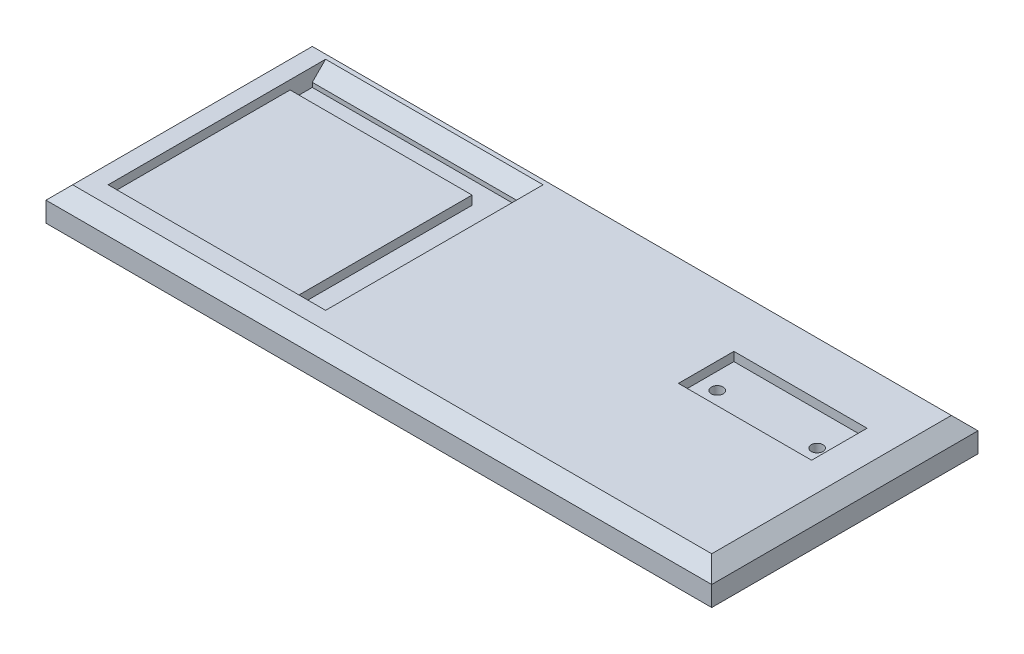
ISO-10303-21;
HEADER;
FILE_DESCRIPTION(('STEP AP214'),'2;1');
FILE_NAME('part.step','',(''),(''),'','','');
FILE_SCHEMA(('AUTOMOTIVE_DESIGN { 1 0 10303 214 1 1 1 1 }'));
ENDSEC;
DATA;
#1=APPLICATION_CONTEXT('core data for automotive mechanical design processes');
#2=APPLICATION_PROTOCOL_DEFINITION('international standard','automotive_design',2000,#1);
#3=PRODUCT_CONTEXT('',#1,'mechanical');
#4=PRODUCT('Part','Part','',(#3));
#5=PRODUCT_RELATED_PRODUCT_CATEGORY('part','',(#4));
#6=PRODUCT_DEFINITION_FORMATION('','',#4);
#7=PRODUCT_DEFINITION_CONTEXT('part definition',#1,'design');
#8=PRODUCT_DEFINITION('design','',#6,#7);
#9=PRODUCT_DEFINITION_SHAPE('','',#8);
#10=(LENGTH_UNIT() NAMED_UNIT(*) SI_UNIT(.MILLI.,.METRE.));
#11=(NAMED_UNIT(*) PLANE_ANGLE_UNIT() SI_UNIT($,.RADIAN.));
#12=(NAMED_UNIT(*) SI_UNIT($,.STERADIAN.) SOLID_ANGLE_UNIT());
#13=UNCERTAINTY_MEASURE_WITH_UNIT(LENGTH_MEASURE(1.E-05),#10,'distance_accuracy_value','');
#14=(GEOMETRIC_REPRESENTATION_CONTEXT(3) GLOBAL_UNCERTAINTY_ASSIGNED_CONTEXT((#13)) GLOBAL_UNIT_ASSIGNED_CONTEXT((#10,
#11,#12)) REPRESENTATION_CONTEXT('',''));
#15=CARTESIAN_POINT('',(0.,0.,0.));
#16=DIRECTION('',(0.,0.,1.));
#17=DIRECTION('',(1.,0.,0.));
#18=AXIS2_PLACEMENT_3D('',#15,#16,#17);
#19=CARTESIAN_POINT('',(-319.318472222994,-19.05,0.));
#20=DIRECTION('',(0.,1.,0.));
#21=DIRECTION('',(0.,0.,1.));
#22=AXIS2_PLACEMENT_3D('',#19,#20,#21);
#23=PLANE('',#22);
#24=CARTESIAN_POINT('',(155.575,-19.05,-19.05));
#25=DIRECTION('',(0.,-1.,0.));
#26=DIRECTION('',(0.,0.,-1.));
#27=AXIS2_PLACEMENT_3D('',#24,#25,#26);
#28=CIRCLE('',#27,7.14375);
#29=CARTESIAN_POINT('',(155.575,-19.05,-26.19375));
#30=VERTEX_POINT('',#29);
#31=EDGE_CURVE('E283',#30,#30,#28,.T.);
#32=ORIENTED_EDGE('',*,*,#31,.F.);
#33=EDGE_LOOP('',(#32));
#34=FACE_BOUND('',#33,.T.);
#35=DIRECTION('',(-1.,0.,0.));
#36=VECTOR('',#35,1.);
#37=CARTESIAN_POINT('',(-319.318472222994,-19.05,-76.1999999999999));
#38=LINE('',#37,#36);
#39=CARTESIAN_POINT('',(190.5,-19.05,-76.2));
#40=VERTEX_POINT('',#39);
#41=CARTESIAN_POINT('',(-190.5,-19.05,-76.2));
#42=VERTEX_POINT('',#41);
#43=EDGE_CURVE('E391',#40,#42,#38,.T.);
#44=ORIENTED_EDGE('',*,*,#43,.F.);
#45=DIRECTION('',(0.,0.,1.));
#46=VECTOR('',#45,1.);
#47=CARTESIAN_POINT('',(190.5,-19.05,0.));
#48=LINE('',#47,#46);
#49=CARTESIAN_POINT('',(190.5,-19.05,76.2));
#50=VERTEX_POINT('',#49);
#51=EDGE_CURVE('E405',#40,#50,#48,.T.);
#52=ORIENTED_EDGE('',*,*,#51,.T.);
#53=DIRECTION('',(-1.,0.,0.));
#54=VECTOR('',#53,1.);
#55=CARTESIAN_POINT('',(-319.318472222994,-19.05,76.2000000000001));
#56=LINE('',#55,#54);
#57=CARTESIAN_POINT('',(-190.5,-19.05,76.2));
#58=VERTEX_POINT('',#57);
#59=EDGE_CURVE('E403',#50,#58,#56,.T.);
#60=ORIENTED_EDGE('',*,*,#59,.T.);
#61=DIRECTION('',(0.,0.,1.));
#62=VECTOR('',#61,1.);
#63=CARTESIAN_POINT('',(-190.5,-19.05,0.));
#64=LINE('',#63,#62);
#65=EDGE_CURVE('E400',#42,#58,#64,.T.);
#66=ORIENTED_EDGE('',*,*,#65,.F.);
#67=EDGE_LOOP('',(#44,#52,#60,#66));
#68=FACE_BOUND('',#67,.T.);
#69=CARTESIAN_POINT('',(98.425,-19.05,-19.05));
#70=DIRECTION('',(0.,-1.,0.));
#71=DIRECTION('',(0.,0.,-1.));
#72=AXIS2_PLACEMENT_3D('',#69,#70,#71);
#73=CIRCLE('',#72,7.14375);
#74=CARTESIAN_POINT('',(98.425,-19.05,-26.19375));
#75=VERTEX_POINT('',#74);
#76=EDGE_CURVE('E242',#75,#75,#73,.T.);
#77=ORIENTED_EDGE('',*,*,#76,.F.);
#78=EDGE_LOOP('',(#77));
#79=FACE_BOUND('',#78,.T.);
#80=ADVANCED_FACE('F40',(#34,#68,#79),#23,.F.);
#81=CARTESIAN_POINT('',(-319.318472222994,0.,0.));
#82=DIRECTION('',(0.,1.,0.));
#83=DIRECTION('',(0.,0.,1.));
#84=AXIS2_PLACEMENT_3D('',#81,#82,#83);
#85=PLANE('',#84);
#86=DIRECTION('',(1.,0.,0.));
#87=VECTOR('',#86,1.);
#88=CARTESIAN_POINT('',(190.5,0.,68.58));
#89=LINE('',#88,#87);
#90=CARTESIAN_POINT('',(-182.88,0.,68.58));
#91=VERTEX_POINT('',#90);
#92=CARTESIAN_POINT('',(182.88,0.,68.58));
#93=VERTEX_POINT('',#92);
#94=EDGE_CURVE('E259',#91,#93,#89,.T.);
#95=ORIENTED_EDGE('',*,*,#94,.T.);
#96=DIRECTION('',(0.,0.,-1.));
#97=VECTOR('',#96,1.);
#98=CARTESIAN_POINT('',(182.88,0.,-76.2));
#99=LINE('',#98,#97);
#100=CARTESIAN_POINT('',(182.88,0.,-68.58));
#101=VERTEX_POINT('',#100);
#102=EDGE_CURVE('E261',#93,#101,#99,.T.);
#103=ORIENTED_EDGE('',*,*,#102,.T.);
#104=DIRECTION('',(-1.,0.,0.));
#105=VECTOR('',#104,1.);
#106=CARTESIAN_POINT('',(-319.318472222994,0.,-68.5799999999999));
#107=LINE('',#106,#105);
#108=CARTESIAN_POINT('',(-182.88,0.,-68.5799999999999));
#109=VERTEX_POINT('',#108);
#110=EDGE_CURVE('E255',#101,#109,#107,.T.);
#111=ORIENTED_EDGE('',*,*,#110,.T.);
#112=DIRECTION('',(0.,0.,1.));
#113=VECTOR('',#112,1.);
#114=CARTESIAN_POINT('',(-182.88,0.,0.));
#115=LINE('',#114,#113);
#116=EDGE_CURVE('E257',#109,#91,#115,.T.);
#117=ORIENTED_EDGE('',*,*,#116,.T.);
#118=EDGE_LOOP('',(#95,#103,#111,#117));
#119=FACE_BOUND('',#118,.T.);
#120=DIRECTION('',(0.,0.,1.));
#121=VECTOR('',#120,1.);
#122=CARTESIAN_POINT('',(-48.2600000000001,0.,0.));
#123=LINE('',#122,#121);
#124=CARTESIAN_POINT('',(-48.2600000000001,0.,-66.0399999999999));
#125=VERTEX_POINT('',#124);
#126=CARTESIAN_POINT('',(-48.2600000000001,0.,58.42));
#127=VERTEX_POINT('',#126);
#128=EDGE_CURVE('E251',#125,#127,#123,.T.);
#129=ORIENTED_EDGE('',*,*,#128,.T.);
#130=DIRECTION('',(-1.,0.,0.));
#131=VECTOR('',#130,1.);
#132=CARTESIAN_POINT('',(-319.318472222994,0.,58.4199999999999));
#133=LINE('',#132,#131);
#134=CARTESIAN_POINT('',(-172.72,0.,58.42));
#135=VERTEX_POINT('',#134);
#136=EDGE_CURVE('E425',#127,#135,#133,.T.);
#137=ORIENTED_EDGE('',*,*,#136,.T.);
#138=DIRECTION('',(0.,0.,1.));
#139=VECTOR('',#138,1.);
#140=CARTESIAN_POINT('',(-172.72,0.,0.));
#141=LINE('',#140,#139);
#142=CARTESIAN_POINT('',(-172.72,0.,-66.04));
#143=VERTEX_POINT('',#142);
#144=EDGE_CURVE('E383',#143,#135,#141,.T.);
#145=ORIENTED_EDGE('',*,*,#144,.F.);
#146=DIRECTION('',(1.,0.,0.));
#147=VECTOR('',#146,1.);
#148=CARTESIAN_POINT('',(-55.88,0.,-66.0399999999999));
#149=LINE('',#148,#147);
#150=EDGE_CURVE('E247',#143,#125,#149,.T.);
#151=ORIENTED_EDGE('',*,*,#150,.T.);
#152=EDGE_LOOP('',(#129,#137,#145,#151));
#153=FACE_BOUND('',#152,.T.);
#154=DIRECTION('',(1.,0.,0.));
#155=VECTOR('',#154,1.);
#156=CARTESIAN_POINT('',(-319.318472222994,0.,-38.1));
#157=LINE('',#156,#155);
#158=CARTESIAN_POINT('',(88.9,0.,-38.1));
#159=VERTEX_POINT('',#158);
#160=CARTESIAN_POINT('',(165.1,0.,-38.1));
#161=VERTEX_POINT('',#160);
#162=EDGE_CURVE('E461',#159,#161,#157,.T.);
#163=ORIENTED_EDGE('',*,*,#162,.T.);
#164=DIRECTION('',(0.,0.,1.));
#165=VECTOR('',#164,1.);
#166=CARTESIAN_POINT('',(165.1,0.,-3.48490408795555E-13));
#167=LINE('',#166,#165);
#168=CARTESIAN_POINT('',(165.1,0.,-6.34999999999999));
#169=VERTEX_POINT('',#168);
#170=EDGE_CURVE('E458',#161,#169,#167,.T.);
#171=ORIENTED_EDGE('',*,*,#170,.T.);
#172=DIRECTION('',(1.,0.,0.));
#173=VECTOR('',#172,1.);
#174=CARTESIAN_POINT('',(-319.318472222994,0.,-6.34999999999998));
#175=LINE('',#174,#173);
#176=CARTESIAN_POINT('',(88.9,0.,-6.34999999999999));
#177=VERTEX_POINT('',#176);
#178=EDGE_CURVE('E436',#177,#169,#175,.T.);
#179=ORIENTED_EDGE('',*,*,#178,.F.);
#180=DIRECTION('',(0.,0.,1.));
#181=VECTOR('',#180,1.);
#182=CARTESIAN_POINT('',(88.9,0.,0.));
#183=LINE('',#182,#181);
#184=EDGE_CURVE('E462',#159,#177,#183,.T.);
#185=ORIENTED_EDGE('',*,*,#184,.F.);
#186=EDGE_LOOP('',(#163,#171,#179,#185));
#187=FACE_BOUND('',#186,.T.);
#188=ADVANCED_FACE('F322',(#119,#153,#187),#85,.T.);
#189=CARTESIAN_POINT('',(-319.318472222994,-19.05,-76.1999999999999));
#190=DIRECTION('',(0.,0.,-1.));
#191=DIRECTION('',(-1.,0.,0.));
#192=AXIS2_PLACEMENT_3D('',#189,#190,#191);
#193=PLANE('',#192);
#194=DIRECTION('',(0.,1.,0.));
#195=VECTOR('',#194,1.);
#196=CARTESIAN_POINT('',(-190.5,-19.05,-76.2));
#197=LINE('',#196,#195);
#198=CARTESIAN_POINT('',(-190.5,-7.62000000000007,-76.2));
#199=VERTEX_POINT('',#198);
#200=EDGE_CURVE('E407',#42,#199,#197,.T.);
#201=ORIENTED_EDGE('',*,*,#200,.T.);
#202=DIRECTION('',(1.,0.,0.));
#203=VECTOR('',#202,1.);
#204=CARTESIAN_POINT('',(-319.318472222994,-7.62000000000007,-76.1999999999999));
#205=LINE('',#204,#203);
#206=CARTESIAN_POINT('',(190.5,-7.62000000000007,-76.2));
#207=VERTEX_POINT('',#206);
#208=EDGE_CURVE('E268',#199,#207,#205,.T.);
#209=ORIENTED_EDGE('',*,*,#208,.T.);
#210=DIRECTION('',(0.,1.,0.));
#211=VECTOR('',#210,1.);
#212=CARTESIAN_POINT('',(190.5,-19.05,-76.2));
#213=LINE('',#212,#211);
#214=EDGE_CURVE('E248',#40,#207,#213,.T.);
#215=ORIENTED_EDGE('',*,*,#214,.F.);
#216=ORIENTED_EDGE('',*,*,#43,.T.);
#217=EDGE_LOOP('',(#201,#209,#215,#216));
#218=FACE_BOUND('',#217,.T.);
#219=ADVANCED_FACE('F328',(#218),#193,.T.);
#220=CARTESIAN_POINT('',(190.5,-19.05,0.));
#221=DIRECTION('',(-1.,0.,0.));
#222=DIRECTION('',(0.,0.,1.));
#223=AXIS2_PLACEMENT_3D('',#220,#221,#222);
#224=PLANE('',#223);
#225=ORIENTED_EDGE('',*,*,#214,.T.);
#226=DIRECTION('',(0.,0.,1.));
#227=VECTOR('',#226,1.);
#228=CARTESIAN_POINT('',(190.5,-7.62000000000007,76.2));
#229=LINE('',#228,#227);
#230=CARTESIAN_POINT('',(190.5,-7.62000000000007,76.2));
#231=VERTEX_POINT('',#230);
#232=EDGE_CURVE('E244',#207,#231,#229,.T.);
#233=ORIENTED_EDGE('',*,*,#232,.T.);
#234=DIRECTION('',(0.,1.,0.));
#235=VECTOR('',#234,1.);
#236=CARTESIAN_POINT('',(190.5,-19.05,76.2));
#237=LINE('',#236,#235);
#238=EDGE_CURVE('E410',#50,#231,#237,.T.);
#239=ORIENTED_EDGE('',*,*,#238,.F.);
#240=ORIENTED_EDGE('',*,*,#51,.F.);
#241=EDGE_LOOP('',(#225,#233,#239,#240));
#242=FACE_BOUND('',#241,.T.);
#243=ADVANCED_FACE('F335',(#242),#224,.F.);
#244=CARTESIAN_POINT('',(-319.318472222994,-19.05,76.2000000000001));
#245=DIRECTION('',(0.,0.,-1.));
#246=DIRECTION('',(-1.,0.,0.));
#247=AXIS2_PLACEMENT_3D('',#244,#245,#246);
#248=PLANE('',#247);
#249=ORIENTED_EDGE('',*,*,#238,.T.);
#250=DIRECTION('',(-1.,0.,0.));
#251=VECTOR('',#250,1.);
#252=CARTESIAN_POINT('',(-190.5,-7.62000000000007,76.2));
#253=LINE('',#252,#251);
#254=CARTESIAN_POINT('',(-190.5,-7.62000000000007,76.2));
#255=VERTEX_POINT('',#254);
#256=EDGE_CURVE('E264',#231,#255,#253,.T.);
#257=ORIENTED_EDGE('',*,*,#256,.T.);
#258=DIRECTION('',(0.,1.,0.));
#259=VECTOR('',#258,1.);
#260=CARTESIAN_POINT('',(-190.5,-19.05,76.2));
#261=LINE('',#260,#259);
#262=EDGE_CURVE('E413',#58,#255,#261,.T.);
#263=ORIENTED_EDGE('',*,*,#262,.F.);
#264=ORIENTED_EDGE('',*,*,#59,.F.);
#265=EDGE_LOOP('',(#249,#257,#263,#264));
#266=FACE_BOUND('',#265,.T.);
#267=ADVANCED_FACE('F338',(#266),#248,.F.);
#268=CARTESIAN_POINT('',(-190.5,-19.05,0.));
#269=DIRECTION('',(-1.,0.,0.));
#270=DIRECTION('',(0.,0.,1.));
#271=AXIS2_PLACEMENT_3D('',#268,#269,#270);
#272=PLANE('',#271);
#273=ORIENTED_EDGE('',*,*,#262,.T.);
#274=DIRECTION('',(0.,0.,-1.));
#275=VECTOR('',#274,1.);
#276=CARTESIAN_POINT('',(-190.5,-7.62000000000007,0.));
#277=LINE('',#276,#275);
#278=EDGE_CURVE('E266',#255,#199,#277,.T.);
#279=ORIENTED_EDGE('',*,*,#278,.T.);
#280=ORIENTED_EDGE('',*,*,#200,.F.);
#281=ORIENTED_EDGE('',*,*,#65,.T.);
#282=EDGE_LOOP('',(#273,#279,#280,#281));
#283=FACE_BOUND('',#282,.T.);
#284=ADVANCED_FACE('F342',(#283),#272,.T.);
#285=CARTESIAN_POINT('',(-319.318472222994,-5.08,58.4199999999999));
#286=DIRECTION('',(0.,0.,-1.));
#287=DIRECTION('',(-1.,0.,0.));
#288=AXIS2_PLACEMENT_3D('',#285,#286,#287);
#289=PLANE('',#288);
#290=ORIENTED_EDGE('',*,*,#136,.F.);
#291=DIRECTION('',(0.707106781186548,0.707106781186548,0.));
#292=VECTOR('',#291,1.);
#293=CARTESIAN_POINT('',(-48.2600000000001,0.,58.42));
#294=LINE('',#293,#292);
#295=CARTESIAN_POINT('',(-55.88,-7.61999999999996,58.42));
#296=VERTEX_POINT('',#295);
#297=EDGE_CURVE('E49',#127,#296,#294,.F.);
#298=ORIENTED_EDGE('',*,*,#297,.T.);
#299=DIRECTION('',(0.,1.,0.));
#300=VECTOR('',#299,1.);
#301=CARTESIAN_POINT('',(-55.88,-5.08,58.42));
#302=LINE('',#301,#300);
#303=CARTESIAN_POINT('',(-55.88,-10.16,58.42));
#304=VERTEX_POINT('',#303);
#305=EDGE_CURVE('E188',#304,#296,#302,.T.);
#306=ORIENTED_EDGE('',*,*,#305,.F.);
#307=DIRECTION('',(1.,0.,0.));
#308=VECTOR('',#307,1.);
#309=CARTESIAN_POINT('',(-55.88,-10.16,58.42));
#310=LINE('',#309,#308);
#311=CARTESIAN_POINT('',(-68.5800000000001,-10.16,58.42));
#312=VERTEX_POINT('',#311);
#313=EDGE_CURVE('E186',#312,#304,#310,.T.);
#314=ORIENTED_EDGE('',*,*,#313,.F.);
#315=DIRECTION('',(0.,1.,0.));
#316=VECTOR('',#315,1.);
#317=CARTESIAN_POINT('',(-68.5800000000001,-10.16,58.42));
#318=LINE('',#317,#316);
#319=CARTESIAN_POINT('',(-68.5800000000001,-5.08,58.42));
#320=VERTEX_POINT('',#319);
#321=EDGE_CURVE('E172',#312,#320,#318,.T.);
#322=ORIENTED_EDGE('',*,*,#321,.T.);
#323=DIRECTION('',(-1.,0.,0.));
#324=VECTOR('',#323,1.);
#325=CARTESIAN_POINT('',(-319.318472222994,-5.08,58.4199999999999));
#326=LINE('',#325,#324);
#327=CARTESIAN_POINT('',(-172.72,-5.08,58.42));
#328=VERTEX_POINT('',#327);
#329=EDGE_CURVE('E417',#320,#328,#326,.T.);
#330=ORIENTED_EDGE('',*,*,#329,.T.);
#331=DIRECTION('',(0.,1.,0.));
#332=VECTOR('',#331,1.);
#333=CARTESIAN_POINT('',(-172.72,-5.08,58.42));
#334=LINE('',#333,#332);
#335=EDGE_CURVE('E388',#328,#135,#334,.T.);
#336=ORIENTED_EDGE('',*,*,#335,.T.);
#337=EDGE_LOOP('',(#290,#298,#306,#314,#322,#330,#336));
#338=FACE_BOUND('',#337,.T.);
#339=ADVANCED_FACE('F187',(#338),#289,.T.);
#340=CARTESIAN_POINT('',(-172.72,-5.08,0.));
#341=DIRECTION('',(-1.,0.,0.));
#342=DIRECTION('',(0.,0.,1.));
#343=AXIS2_PLACEMENT_3D('',#340,#341,#342);
#344=PLANE('',#343);
#345=ORIENTED_EDGE('',*,*,#144,.T.);
#346=ORIENTED_EDGE('',*,*,#335,.F.);
#347=DIRECTION('',(0.,0.,1.));
#348=VECTOR('',#347,1.);
#349=CARTESIAN_POINT('',(-172.72,-5.08,0.));
#350=LINE('',#349,#348);
#351=CARTESIAN_POINT('',(-172.72,-5.08,-45.72));
#352=VERTEX_POINT('',#351);
#353=EDGE_CURVE('E224',#352,#328,#350,.T.);
#354=ORIENTED_EDGE('',*,*,#353,.F.);
#355=DIRECTION('',(0.,1.,0.));
#356=VECTOR('',#355,1.);
#357=CARTESIAN_POINT('',(-172.72,-10.16,-45.72));
#358=LINE('',#357,#356);
#359=CARTESIAN_POINT('',(-172.72,-10.16,-45.72));
#360=VERTEX_POINT('',#359);
#361=EDGE_CURVE('E182',#360,#352,#358,.T.);
#362=ORIENTED_EDGE('',*,*,#361,.F.);
#363=DIRECTION('',(0.,0.,1.));
#364=VECTOR('',#363,1.);
#365=CARTESIAN_POINT('',(-172.72,-10.16,-58.42));
#366=LINE('',#365,#364);
#367=CARTESIAN_POINT('',(-172.72,-10.16,-58.42));
#368=VERTEX_POINT('',#367);
#369=EDGE_CURVE('E215',#368,#360,#366,.T.);
#370=ORIENTED_EDGE('',*,*,#369,.F.);
#371=DIRECTION('',(0.,1.,0.));
#372=VECTOR('',#371,1.);
#373=CARTESIAN_POINT('',(-172.72,-5.08,-58.42));
#374=LINE('',#373,#372);
#375=CARTESIAN_POINT('',(-172.72,-7.61999999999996,-58.42));
#376=VERTEX_POINT('',#375);
#377=EDGE_CURVE('E386',#368,#376,#374,.T.);
#378=ORIENTED_EDGE('',*,*,#377,.T.);
#379=DIRECTION('',(0.,0.707106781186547,-0.707106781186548));
#380=VECTOR('',#379,1.);
#381=CARTESIAN_POINT('',(-172.72,-35.56,-30.4799999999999));
#382=LINE('',#381,#380);
#383=EDGE_CURVE('E11',#376,#143,#382,.T.);
#384=ORIENTED_EDGE('',*,*,#383,.T.);
#385=EDGE_LOOP('',(#345,#346,#354,#362,#370,#378,#384));
#386=FACE_BOUND('',#385,.T.);
#387=ADVANCED_FACE('F381',(#386),#344,.F.);
#388=CARTESIAN_POINT('',(-319.318472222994,-5.08,-58.4200000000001));
#389=DIRECTION('',(0.,0.,-1.));
#390=DIRECTION('',(-1.,0.,0.));
#391=AXIS2_PLACEMENT_3D('',#388,#389,#390);
#392=PLANE('',#391);
#393=DIRECTION('',(0.,1.,0.));
#394=VECTOR('',#393,1.);
#395=CARTESIAN_POINT('',(-55.88,-5.08,-58.42));
#396=LINE('',#395,#394);
#397=CARTESIAN_POINT('',(-55.8800000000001,-10.16,-58.42));
#398=VERTEX_POINT('',#397);
#399=CARTESIAN_POINT('',(-55.88,-7.61999999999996,-58.42));
#400=VERTEX_POINT('',#399);
#401=EDGE_CURVE('E389',#398,#400,#396,.T.);
#402=ORIENTED_EDGE('',*,*,#401,.T.);
#403=DIRECTION('',(-1.,0.,0.));
#404=VECTOR('',#403,1.);
#405=CARTESIAN_POINT('',(-172.72,-7.61999999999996,-58.42));
#406=LINE('',#405,#404);
#407=EDGE_CURVE('E57',#400,#376,#406,.T.);
#408=ORIENTED_EDGE('',*,*,#407,.T.);
#409=ORIENTED_EDGE('',*,*,#377,.F.);
#410=DIRECTION('',(-1.,0.,0.));
#411=VECTOR('',#410,1.);
#412=CARTESIAN_POINT('',(-55.8800000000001,-10.16,-58.42));
#413=LINE('',#412,#411);
#414=EDGE_CURVE('E211',#398,#368,#413,.T.);
#415=ORIENTED_EDGE('',*,*,#414,.F.);
#416=EDGE_LOOP('',(#402,#408,#409,#415));
#417=FACE_BOUND('',#416,.T.);
#418=ADVANCED_FACE('F500',(#417),#392,.F.);
#419=CARTESIAN_POINT('',(-55.88,-5.08,0.));
#420=DIRECTION('',(-1.,0.,0.));
#421=DIRECTION('',(0.,0.,1.));
#422=AXIS2_PLACEMENT_3D('',#419,#420,#421);
#423=PLANE('',#422);
#424=ORIENTED_EDGE('',*,*,#305,.T.);
#425=DIRECTION('',(0.,0.,-1.));
#426=VECTOR('',#425,1.);
#427=CARTESIAN_POINT('',(-55.88,-7.61999999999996,0.));
#428=LINE('',#427,#426);
#429=EDGE_CURVE('E270',#296,#400,#428,.T.);
#430=ORIENTED_EDGE('',*,*,#429,.T.);
#431=ORIENTED_EDGE('',*,*,#401,.F.);
#432=DIRECTION('',(0.,0.,-1.));
#433=VECTOR('',#432,1.);
#434=CARTESIAN_POINT('',(-55.8800000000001,-10.16,-58.42));
#435=LINE('',#434,#433);
#436=EDGE_CURVE('E192',#304,#398,#435,.T.);
#437=ORIENTED_EDGE('',*,*,#436,.F.);
#438=EDGE_LOOP('',(#424,#430,#431,#437));
#439=FACE_BOUND('',#438,.T.);
#440=ADVANCED_FACE('F496',(#439),#423,.T.);
#441=CARTESIAN_POINT('',(-319.318472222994,-5.08,0.));
#442=DIRECTION('',(0.,1.,0.));
#443=DIRECTION('',(0.,0.,1.));
#444=AXIS2_PLACEMENT_3D('',#441,#442,#443);
#445=PLANE('',#444);
#446=DIRECTION('',(0.,0.,1.));
#447=VECTOR('',#446,1.);
#448=CARTESIAN_POINT('',(-68.5800000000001,-5.08,-45.72));
#449=LINE('',#448,#447);
#450=CARTESIAN_POINT('',(-68.5800000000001,-5.08,-45.72));
#451=VERTEX_POINT('',#450);
#452=EDGE_CURVE('E179',#451,#320,#449,.T.);
#453=ORIENTED_EDGE('',*,*,#452,.F.);
#454=DIRECTION('',(1.,0.,0.));
#455=VECTOR('',#454,1.);
#456=CARTESIAN_POINT('',(-68.5800000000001,-5.08,-45.72));
#457=LINE('',#456,#455);
#458=EDGE_CURVE('E198',#352,#451,#457,.T.);
#459=ORIENTED_EDGE('',*,*,#458,.F.);
#460=ORIENTED_EDGE('',*,*,#353,.T.);
#461=ORIENTED_EDGE('',*,*,#329,.F.);
#462=EDGE_LOOP('',(#453,#459,#460,#461));
#463=FACE_BOUND('',#462,.T.);
#464=ADVANCED_FACE('F493',(#463),#445,.T.);
#465=CARTESIAN_POINT('',(165.1,-5.08,-3.48490408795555E-13));
#466=DIRECTION('',(-1.,0.,0.));
#467=DIRECTION('',(0.,0.,1.));
#468=AXIS2_PLACEMENT_3D('',#465,#466,#467);
#469=PLANE('',#468);
#470=ORIENTED_EDGE('',*,*,#170,.F.);
#471=DIRECTION('',(0.,1.,0.));
#472=VECTOR('',#471,1.);
#473=CARTESIAN_POINT('',(165.1,-5.08,-38.1));
#474=LINE('',#473,#472);
#475=CARTESIAN_POINT('',(165.1,-5.08,-38.1));
#476=VERTEX_POINT('',#475);
#477=EDGE_CURVE('E421',#476,#161,#474,.T.);
#478=ORIENTED_EDGE('',*,*,#477,.F.);
#479=DIRECTION('',(0.,0.,1.));
#480=VECTOR('',#479,1.);
#481=CARTESIAN_POINT('',(165.1,-5.08,-3.48490408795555E-13));
#482=LINE('',#481,#480);
#483=CARTESIAN_POINT('',(165.1,-5.08,-6.34999999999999));
#484=VERTEX_POINT('',#483);
#485=EDGE_CURVE('E465',#476,#484,#482,.T.);
#486=ORIENTED_EDGE('',*,*,#485,.T.);
#487=DIRECTION('',(0.,1.,0.));
#488=VECTOR('',#487,1.);
#489=CARTESIAN_POINT('',(165.1,-5.08,-6.34999999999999));
#490=LINE('',#489,#488);
#491=EDGE_CURVE('E426',#484,#169,#490,.T.);
#492=ORIENTED_EDGE('',*,*,#491,.T.);
#493=EDGE_LOOP('',(#470,#478,#486,#492));
#494=FACE_BOUND('',#493,.T.);
#495=ADVANCED_FACE('F469',(#494),#469,.T.);
#496=CARTESIAN_POINT('',(-319.318472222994,-5.08,-6.34999999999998));
#497=DIRECTION('',(0.,0.,1.));
#498=DIRECTION('',(1.,0.,0.));
#499=AXIS2_PLACEMENT_3D('',#496,#497,#498);
#500=PLANE('',#499);
#501=ORIENTED_EDGE('',*,*,#178,.T.);
#502=ORIENTED_EDGE('',*,*,#491,.F.);
#503=DIRECTION('',(1.,0.,0.));
#504=VECTOR('',#503,1.);
#505=CARTESIAN_POINT('',(-319.318472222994,-5.08,-6.34999999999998));
#506=LINE('',#505,#504);
#507=CARTESIAN_POINT('',(88.9,-5.08,-6.34999999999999));
#508=VERTEX_POINT('',#507);
#509=EDGE_CURVE('E443',#508,#484,#506,.T.);
#510=ORIENTED_EDGE('',*,*,#509,.F.);
#511=DIRECTION('',(0.,1.,0.));
#512=VECTOR('',#511,1.);
#513=CARTESIAN_POINT('',(88.9,-5.08,-6.34999999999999));
#514=LINE('',#513,#512);
#515=EDGE_CURVE('E428',#508,#177,#514,.T.);
#516=ORIENTED_EDGE('',*,*,#515,.T.);
#517=EDGE_LOOP('',(#501,#502,#510,#516));
#518=FACE_BOUND('',#517,.T.);
#519=ADVANCED_FACE('F486',(#518),#500,.F.);
#520=CARTESIAN_POINT('',(88.9,-5.08,0.));
#521=DIRECTION('',(-1.,0.,0.));
#522=DIRECTION('',(0.,0.,1.));
#523=AXIS2_PLACEMENT_3D('',#520,#521,#522);
#524=PLANE('',#523);
#525=ORIENTED_EDGE('',*,*,#184,.T.);
#526=ORIENTED_EDGE('',*,*,#515,.F.);
#527=DIRECTION('',(0.,0.,1.));
#528=VECTOR('',#527,1.);
#529=CARTESIAN_POINT('',(88.9,-5.08,0.));
#530=LINE('',#529,#528);
#531=CARTESIAN_POINT('',(88.9,-5.08,-38.1));
#532=VERTEX_POINT('',#531);
#533=EDGE_CURVE('E448',#532,#508,#530,.T.);
#534=ORIENTED_EDGE('',*,*,#533,.F.);
#535=DIRECTION('',(0.,1.,0.));
#536=VECTOR('',#535,1.);
#537=CARTESIAN_POINT('',(88.9,-5.08,-38.1));
#538=LINE('',#537,#536);
#539=EDGE_CURVE('E433',#532,#159,#538,.T.);
#540=ORIENTED_EDGE('',*,*,#539,.T.);
#541=EDGE_LOOP('',(#525,#526,#534,#540));
#542=FACE_BOUND('',#541,.T.);
#543=ADVANCED_FACE('F480',(#542),#524,.F.);
#544=CARTESIAN_POINT('',(-319.318472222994,-5.08,-38.1));
#545=DIRECTION('',(0.,0.,1.));
#546=DIRECTION('',(1.,0.,0.));
#547=AXIS2_PLACEMENT_3D('',#544,#545,#546);
#548=PLANE('',#547);
#549=ORIENTED_EDGE('',*,*,#162,.F.);
#550=ORIENTED_EDGE('',*,*,#539,.F.);
#551=DIRECTION('',(1.,0.,0.));
#552=VECTOR('',#551,1.);
#553=CARTESIAN_POINT('',(-319.318472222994,-5.08,-38.1));
#554=LINE('',#553,#552);
#555=EDGE_CURVE('E454',#532,#476,#554,.T.);
#556=ORIENTED_EDGE('',*,*,#555,.T.);
#557=ORIENTED_EDGE('',*,*,#477,.T.);
#558=EDGE_LOOP('',(#549,#550,#556,#557));
#559=FACE_BOUND('',#558,.T.);
#560=ADVANCED_FACE('F468',(#559),#548,.T.);
#561=CARTESIAN_POINT('',(-319.318472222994,-5.08,0.));
#562=DIRECTION('',(0.,1.,0.));
#563=DIRECTION('',(0.,0.,1.));
#564=AXIS2_PLACEMENT_3D('',#561,#562,#563);
#565=PLANE('',#564);
#566=CARTESIAN_POINT('',(155.575,-5.08,-19.05));
#567=DIRECTION('',(0.,1.,0.));
#568=DIRECTION('',(0.,0.,1.));
#569=AXIS2_PLACEMENT_3D('',#566,#567,#568);
#570=CIRCLE('',#569,3.3782);
#571=CARTESIAN_POINT('',(155.575,-5.08,-15.6718));
#572=VERTEX_POINT('',#571);
#573=EDGE_CURVE('E239',#572,#572,#570,.T.);
#574=ORIENTED_EDGE('',*,*,#573,.F.);
#575=EDGE_LOOP('',(#574));
#576=FACE_BOUND('',#575,.T.);
#577=CARTESIAN_POINT('',(98.425,-5.08,-19.05));
#578=DIRECTION('',(0.,1.,0.));
#579=DIRECTION('',(0.,0.,1.));
#580=AXIS2_PLACEMENT_3D('',#577,#578,#579);
#581=CIRCLE('',#580,3.3782);
#582=CARTESIAN_POINT('',(98.425,-5.08,-15.6718));
#583=VERTEX_POINT('',#582);
#584=EDGE_CURVE('E234',#583,#583,#581,.T.);
#585=ORIENTED_EDGE('',*,*,#584,.F.);
#586=EDGE_LOOP('',(#585));
#587=FACE_BOUND('',#586,.T.);
#588=ORIENTED_EDGE('',*,*,#485,.F.);
#589=ORIENTED_EDGE('',*,*,#555,.F.);
#590=ORIENTED_EDGE('',*,*,#533,.T.);
#591=ORIENTED_EDGE('',*,*,#509,.T.);
#592=EDGE_LOOP('',(#588,#589,#590,#591));
#593=FACE_BOUND('',#592,.T.);
#594=ADVANCED_FACE('F470',(#576,#587,#593),#565,.T.);
#595=CARTESIAN_POINT('',(-68.5800000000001,-10.16,-45.72));
#596=DIRECTION('',(-1.,0.,0.));
#597=DIRECTION('',(0.,0.,1.));
#598=AXIS2_PLACEMENT_3D('',#595,#596,#597);
#599=PLANE('',#598);
#600=ORIENTED_EDGE('',*,*,#452,.T.);
#601=ORIENTED_EDGE('',*,*,#321,.F.);
#602=DIRECTION('',(0.,0.,1.));
#603=VECTOR('',#602,1.);
#604=CARTESIAN_POINT('',(-68.5800000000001,-10.16,-45.72));
#605=LINE('',#604,#603);
#606=CARTESIAN_POINT('',(-68.5800000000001,-10.16,-45.72));
#607=VERTEX_POINT('',#606);
#608=EDGE_CURVE('E176',#607,#312,#605,.T.);
#609=ORIENTED_EDGE('',*,*,#608,.F.);
#610=DIRECTION('',(0.,1.,0.));
#611=VECTOR('',#610,1.);
#612=CARTESIAN_POINT('',(-68.5800000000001,-10.16,-45.72));
#613=LINE('',#612,#611);
#614=EDGE_CURVE('E220',#607,#451,#613,.T.);
#615=ORIENTED_EDGE('',*,*,#614,.T.);
#616=EDGE_LOOP('',(#600,#601,#609,#615));
#617=FACE_BOUND('',#616,.T.);
#618=ADVANCED_FACE('F174',(#617),#599,.F.);
#619=CARTESIAN_POINT('',(-68.5800000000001,-10.16,-45.72));
#620=DIRECTION('',(0.,0.,1.));
#621=DIRECTION('',(1.,0.,0.));
#622=AXIS2_PLACEMENT_3D('',#619,#620,#621);
#623=PLANE('',#622);
#624=ORIENTED_EDGE('',*,*,#458,.T.);
#625=ORIENTED_EDGE('',*,*,#614,.F.);
#626=DIRECTION('',(1.,0.,0.));
#627=VECTOR('',#626,1.);
#628=CARTESIAN_POINT('',(-68.5800000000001,-10.16,-45.72));
#629=LINE('',#628,#627);
#630=EDGE_CURVE('E183',#360,#607,#629,.T.);
#631=ORIENTED_EDGE('',*,*,#630,.F.);
#632=ORIENTED_EDGE('',*,*,#361,.T.);
#633=EDGE_LOOP('',(#624,#625,#631,#632));
#634=FACE_BOUND('',#633,.T.);
#635=ADVANCED_FACE('F478',(#634),#623,.F.);
#636=CARTESIAN_POINT('',(-68.5800000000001,-10.16,58.42));
#637=DIRECTION('',(0.,-1.,0.));
#638=DIRECTION('',(0.,0.,-1.));
#639=AXIS2_PLACEMENT_3D('',#636,#637,#638);
#640=PLANE('',#639);
#641=ORIENTED_EDGE('',*,*,#608,.T.);
#642=ORIENTED_EDGE('',*,*,#313,.T.);
#643=ORIENTED_EDGE('',*,*,#436,.T.);
#644=ORIENTED_EDGE('',*,*,#414,.T.);
#645=ORIENTED_EDGE('',*,*,#369,.T.);
#646=ORIENTED_EDGE('',*,*,#630,.T.);
#647=EDGE_LOOP('',(#641,#642,#643,#644,#645,#646));
#648=FACE_BOUND('',#647,.T.);
#649=ADVANCED_FACE('F194',(#648),#640,.F.);
#650=CARTESIAN_POINT('',(98.425,-19.05,-19.05));
#651=DIRECTION('',(0.,-1.,0.));
#652=DIRECTION('',(0.,0.,-1.));
#653=AXIS2_PLACEMENT_3D('',#650,#651,#652);
#654=CYLINDRICAL_SURFACE('',#653,3.3782);
#655=ORIENTED_EDGE('',*,*,#584,.T.);
#656=EDGE_LOOP('',(#655));
#657=FACE_BOUND('',#656,.T.);
#658=CARTESIAN_POINT('',(98.425,-12.319,-19.05));
#659=DIRECTION('',(0.,-1.,0.));
#660=DIRECTION('',(0.,0.,-1.));
#661=AXIS2_PLACEMENT_3D('',#658,#659,#660);
#662=CIRCLE('',#661,3.3782);
#663=CARTESIAN_POINT('',(98.425,-12.319,-22.4282));
#664=VERTEX_POINT('',#663);
#665=EDGE_CURVE('E206',#664,#664,#662,.T.);
#666=ORIENTED_EDGE('',*,*,#665,.T.);
#667=EDGE_LOOP('',(#666));
#668=FACE_BOUND('',#667,.T.);
#669=ADVANCED_FACE('F306',(#657,#668),#654,.F.);
#670=CARTESIAN_POINT('',(101.8032,-12.319,-19.05));
#671=DIRECTION('',(0.,1.,0.));
#672=DIRECTION('',(0.,0.,1.));
#673=AXIS2_PLACEMENT_3D('',#670,#671,#672);
#674=PLANE('',#673);
#675=ORIENTED_EDGE('',*,*,#665,.F.);
#676=EDGE_LOOP('',(#675));
#677=FACE_BOUND('',#676,.T.);
#678=CARTESIAN_POINT('',(98.425,-12.319,-19.05));
#679=DIRECTION('',(0.,-1.,0.));
#680=DIRECTION('',(0.,0.,-1.));
#681=AXIS2_PLACEMENT_3D('',#678,#679,#680);
#682=CIRCLE('',#681,7.14375);
#683=CARTESIAN_POINT('',(98.425,-12.319,-26.19375));
#684=VERTEX_POINT('',#683);
#685=EDGE_CURVE('E299',#684,#684,#682,.T.);
#686=ORIENTED_EDGE('',*,*,#685,.T.);
#687=EDGE_LOOP('',(#686));
#688=FACE_BOUND('',#687,.T.);
#689=ADVANCED_FACE('F308',(#677,#688),#674,.F.);
#690=CARTESIAN_POINT('',(98.425,-19.05,-19.05));
#691=DIRECTION('',(0.,-1.,0.));
#692=DIRECTION('',(0.,0.,-1.));
#693=AXIS2_PLACEMENT_3D('',#690,#691,#692);
#694=CYLINDRICAL_SURFACE('',#693,7.14375);
#695=ORIENTED_EDGE('',*,*,#685,.F.);
#696=EDGE_LOOP('',(#695));
#697=FACE_BOUND('',#696,.T.);
#698=ORIENTED_EDGE('',*,*,#76,.T.);
#699=EDGE_LOOP('',(#698));
#700=FACE_BOUND('',#699,.T.);
#701=ADVANCED_FACE('F310',(#697,#700),#694,.F.);
#702=CARTESIAN_POINT('',(155.575,-19.05,-19.05));
#703=DIRECTION('',(0.,-1.,0.));
#704=DIRECTION('',(0.,0.,-1.));
#705=AXIS2_PLACEMENT_3D('',#702,#703,#704);
#706=CYLINDRICAL_SURFACE('',#705,3.3782);
#707=ORIENTED_EDGE('',*,*,#573,.T.);
#708=EDGE_LOOP('',(#707));
#709=FACE_BOUND('',#708,.T.);
#710=CARTESIAN_POINT('',(155.575,-12.319,-19.05));
#711=DIRECTION('',(0.,-1.,0.));
#712=DIRECTION('',(0.,0.,-1.));
#713=AXIS2_PLACEMENT_3D('',#710,#711,#712);
#714=CIRCLE('',#713,3.3782);
#715=CARTESIAN_POINT('',(155.575,-12.319,-22.4282));
#716=VERTEX_POINT('',#715);
#717=EDGE_CURVE('E243',#716,#716,#714,.T.);
#718=ORIENTED_EDGE('',*,*,#717,.T.);
#719=EDGE_LOOP('',(#718));
#720=FACE_BOUND('',#719,.T.);
#721=ADVANCED_FACE('F316',(#709,#720),#706,.F.);
#722=CARTESIAN_POINT('',(158.9532,-12.319,-19.05));
#723=DIRECTION('',(0.,1.,0.));
#724=DIRECTION('',(0.,0.,1.));
#725=AXIS2_PLACEMENT_3D('',#722,#723,#724);
#726=PLANE('',#725);
#727=ORIENTED_EDGE('',*,*,#717,.F.);
#728=EDGE_LOOP('',(#727));
#729=FACE_BOUND('',#728,.T.);
#730=CARTESIAN_POINT('',(155.575,-12.319,-19.05));
#731=DIRECTION('',(0.,-1.,0.));
#732=DIRECTION('',(0.,0.,-1.));
#733=AXIS2_PLACEMENT_3D('',#730,#731,#732);
#734=CIRCLE('',#733,7.14375);
#735=CARTESIAN_POINT('',(155.575,-12.319,-26.19375));
#736=VERTEX_POINT('',#735);
#737=EDGE_CURVE('E289',#736,#736,#734,.T.);
#738=ORIENTED_EDGE('',*,*,#737,.T.);
#739=EDGE_LOOP('',(#738));
#740=FACE_BOUND('',#739,.T.);
#741=ADVANCED_FACE('F603',(#729,#740),#726,.F.);
#742=CARTESIAN_POINT('',(155.575,-19.05,-19.05));
#743=DIRECTION('',(0.,-1.,0.));
#744=DIRECTION('',(0.,0.,-1.));
#745=AXIS2_PLACEMENT_3D('',#742,#743,#744);
#746=CYLINDRICAL_SURFACE('',#745,7.14375);
#747=ORIENTED_EDGE('',*,*,#737,.F.);
#748=EDGE_LOOP('',(#747));
#749=FACE_BOUND('',#748,.T.);
#750=ORIENTED_EDGE('',*,*,#31,.T.);
#751=EDGE_LOOP('',(#750));
#752=FACE_BOUND('',#751,.T.);
#753=ADVANCED_FACE('F363',(#749,#752),#746,.F.);
#754=CARTESIAN_POINT('',(-182.88,0.,0.));
#755=DIRECTION('',(0.70710678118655,-0.707106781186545,0.));
#756=DIRECTION('',(0.707106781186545,0.70710678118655,0.));
#757=AXIS2_PLACEMENT_3D('',#754,#755,#756);
#758=PLANE('',#757);
#759=DIRECTION('',(-0.577350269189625,-0.577350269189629,0.577350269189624));
#760=VECTOR('',#759,1.);
#761=CARTESIAN_POINT('',(-160.02,22.86,45.7200000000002));
#762=LINE('',#761,#760);
#763=EDGE_CURVE('E279',#91,#255,#762,.T.);
#764=ORIENTED_EDGE('',*,*,#763,.F.);
#765=ORIENTED_EDGE('',*,*,#116,.F.);
#766=DIRECTION('',(0.577350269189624,0.577350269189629,0.577350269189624));
#767=VECTOR('',#766,1.);
#768=CARTESIAN_POINT('',(-228.359490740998,-45.479490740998,-114.059490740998));
#769=LINE('',#768,#767);
#770=EDGE_CURVE('E281',#199,#109,#769,.T.);
#771=ORIENTED_EDGE('',*,*,#770,.F.);
#772=ORIENTED_EDGE('',*,*,#278,.F.);
#773=EDGE_LOOP('',(#764,#765,#771,#772));
#774=FACE_BOUND('',#773,.T.);
#775=ADVANCED_FACE('F361',(#774),#758,.F.);
#776=CARTESIAN_POINT('',(-319.318472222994,0.,-68.5799999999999));
#777=DIRECTION('',(0.,-0.707106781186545,0.70710678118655));
#778=DIRECTION('',(0.,-0.70710678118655,-0.707106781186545));
#779=AXIS2_PLACEMENT_3D('',#776,#777,#778);
#780=PLANE('',#779);
#781=ORIENTED_EDGE('',*,*,#770,.T.);
#782=ORIENTED_EDGE('',*,*,#110,.F.);
#783=DIRECTION('',(-0.577350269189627,0.577350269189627,0.577350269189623));
#784=VECTOR('',#783,1.);
#785=CARTESIAN_POINT('',(15.4805092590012,167.399490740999,98.8194907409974));
#786=LINE('',#785,#784);
#787=EDGE_CURVE('E277',#207,#101,#786,.T.);
#788=ORIENTED_EDGE('',*,*,#787,.F.);
#789=ORIENTED_EDGE('',*,*,#208,.F.);
#790=EDGE_LOOP('',(#781,#782,#788,#789));
#791=FACE_BOUND('',#790,.T.);
#792=ADVANCED_FACE('F357',(#791),#780,.F.);
#793=CARTESIAN_POINT('',(-319.318472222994,-7.62000000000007,76.2000000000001));
#794=DIRECTION('',(0.,0.707106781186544,0.707106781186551));
#795=DIRECTION('',(0.,-0.707106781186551,0.707106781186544));
#796=AXIS2_PLACEMENT_3D('',#793,#794,#795);
#797=PLANE('',#796);
#798=ORIENTED_EDGE('',*,*,#763,.T.);
#799=ORIENTED_EDGE('',*,*,#256,.F.);
#800=DIRECTION('',(-0.577350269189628,0.577350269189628,-0.577350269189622));
#801=VECTOR('',#800,1.);
#802=CARTESIAN_POINT('',(20.560509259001,162.319490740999,-93.7394907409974));
#803=LINE('',#802,#801);
#804=EDGE_CURVE('E275',#93,#231,#803,.F.);
#805=ORIENTED_EDGE('',*,*,#804,.F.);
#806=ORIENTED_EDGE('',*,*,#94,.F.);
#807=EDGE_LOOP('',(#798,#799,#805,#806));
#808=FACE_BOUND('',#807,.T.);
#809=ADVANCED_FACE('F353',(#808),#797,.T.);
#810=CARTESIAN_POINT('',(190.5,-7.62000000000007,0.));
#811=DIRECTION('',(0.707106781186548,0.707106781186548,0.));
#812=DIRECTION('',(-0.707106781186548,0.707106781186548,0.));
#813=AXIS2_PLACEMENT_3D('',#810,#811,#812);
#814=PLANE('',#813);
#815=ORIENTED_EDGE('',*,*,#787,.T.);
#816=ORIENTED_EDGE('',*,*,#102,.F.);
#817=ORIENTED_EDGE('',*,*,#804,.T.);
#818=ORIENTED_EDGE('',*,*,#232,.F.);
#819=EDGE_LOOP('',(#815,#816,#817,#818));
#820=FACE_BOUND('',#819,.T.);
#821=ADVANCED_FACE('F350',(#820),#814,.T.);
#822=CARTESIAN_POINT('',(-319.318472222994,-7.61999999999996,-58.4200000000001));
#823=DIRECTION('',(0.,0.707106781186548,0.707106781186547));
#824=DIRECTION('',(0.,-0.707106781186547,0.707106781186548));
#825=AXIS2_PLACEMENT_3D('',#822,#823,#824);
#826=PLANE('',#825);
#827=ORIENTED_EDGE('',*,*,#383,.F.);
#828=ORIENTED_EDGE('',*,*,#407,.F.);
#829=DIRECTION('',(-0.577350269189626,-0.577350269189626,0.577350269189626));
#830=VECTOR('',#829,1.);
#831=CARTESIAN_POINT('',(-70.2733333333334,-22.0133333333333,-44.0266666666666));
#832=LINE('',#831,#830);
#833=EDGE_CURVE('E44',#125,#400,#832,.T.);
#834=ORIENTED_EDGE('',*,*,#833,.F.);
#835=ORIENTED_EDGE('',*,*,#150,.F.);
#836=EDGE_LOOP('',(#827,#828,#834,#835));
#837=FACE_BOUND('',#836,.T.);
#838=ADVANCED_FACE('F42',(#837),#826,.T.);
#839=CARTESIAN_POINT('',(-48.2600000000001,0.,0.));
#840=DIRECTION('',(0.707106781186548,-0.707106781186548,0.));
#841=DIRECTION('',(0.707106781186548,0.707106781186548,0.));
#842=AXIS2_PLACEMENT_3D('',#839,#840,#841);
#843=PLANE('',#842);
#844=ORIENTED_EDGE('',*,*,#833,.T.);
#845=ORIENTED_EDGE('',*,*,#429,.F.);
#846=ORIENTED_EDGE('',*,*,#297,.F.);
#847=ORIENTED_EDGE('',*,*,#128,.F.);
#848=EDGE_LOOP('',(#844,#845,#846,#847));
#849=FACE_BOUND('',#848,.T.);
#850=ADVANCED_FACE('F365',(#849),#843,.F.);
#851=CLOSED_SHELL('',(#80,#188,#219,#243,#267,#284,#339,#387,#418,#440,#464,#495,#519,#543,#560,
#594,#618,#635,#649,#669,#689,#701,#721,#741,#753,#775,#792,#809,#821,#838,#850));
#852=MANIFOLD_SOLID_BREP('B2',#851);
#853=ADVANCED_BREP_SHAPE_REPRESENTATION('',(#18,#852),#14);
#854=SHAPE_DEFINITION_REPRESENTATION(#9,#853);
ENDSEC;
END-ISO-10303-21;
